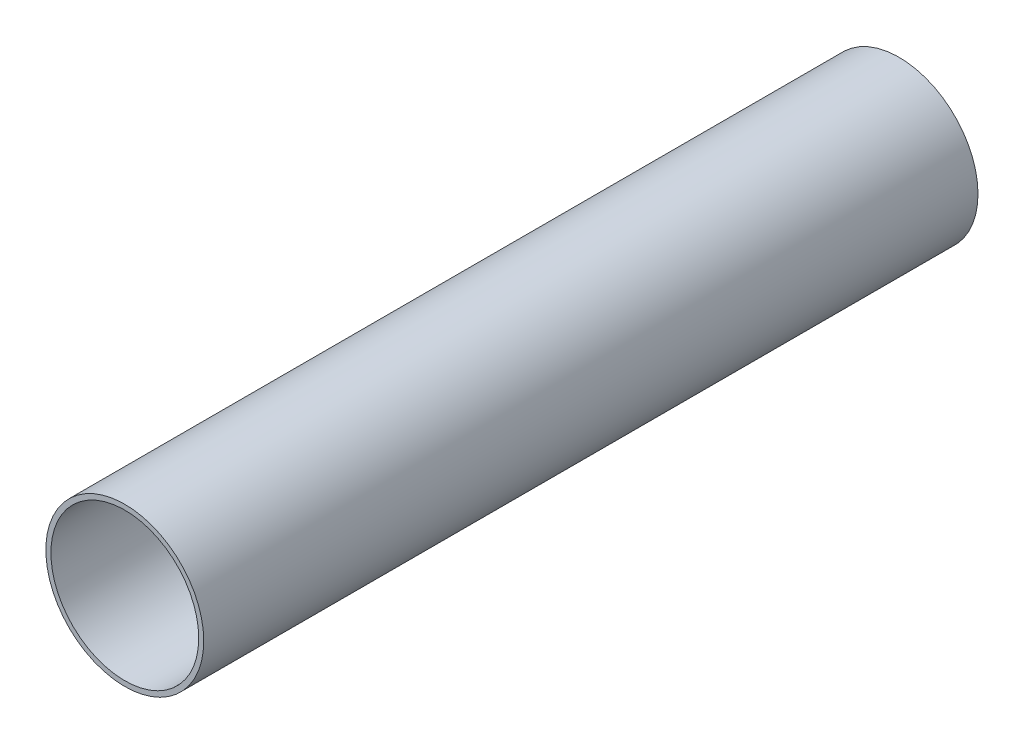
ISO-10303-21;
HEADER;
FILE_DESCRIPTION(('STEP AP214'),'2;1');
FILE_NAME('part.step','',(''),(''),'','','');
FILE_SCHEMA(('AUTOMOTIVE_DESIGN { 1 0 10303 214 1 1 1 1 }'));
ENDSEC;
DATA;
#1=APPLICATION_CONTEXT('core data for automotive mechanical design processes');
#2=APPLICATION_PROTOCOL_DEFINITION('international standard','automotive_design',2000,#1);
#3=PRODUCT_CONTEXT('',#1,'mechanical');
#4=PRODUCT('Part','Part','',(#3));
#5=PRODUCT_RELATED_PRODUCT_CATEGORY('part','',(#4));
#6=PRODUCT_DEFINITION_FORMATION('','',#4);
#7=PRODUCT_DEFINITION_CONTEXT('part definition',#1,'design');
#8=PRODUCT_DEFINITION('design','',#6,#7);
#9=PRODUCT_DEFINITION_SHAPE('','',#8);
#10=(LENGTH_UNIT() NAMED_UNIT(*) SI_UNIT(.MILLI.,.METRE.));
#11=(NAMED_UNIT(*) PLANE_ANGLE_UNIT() SI_UNIT($,.RADIAN.));
#12=(NAMED_UNIT(*) SI_UNIT($,.STERADIAN.) SOLID_ANGLE_UNIT());
#13=UNCERTAINTY_MEASURE_WITH_UNIT(LENGTH_MEASURE(1.E-05),#10,'distance_accuracy_value','');
#14=(GEOMETRIC_REPRESENTATION_CONTEXT(3) GLOBAL_UNCERTAINTY_ASSIGNED_CONTEXT((#13)) GLOBAL_UNIT_ASSIGNED_CONTEXT((#10,
#11,#12)) REPRESENTATION_CONTEXT('',''));
#15=CARTESIAN_POINT('',(0.,0.,0.));
#16=DIRECTION('',(0.,0.,1.));
#17=DIRECTION('',(1.,0.,0.));
#18=AXIS2_PLACEMENT_3D('',#15,#16,#17);
#19=CARTESIAN_POINT('',(-395.,0.,593.825223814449));
#20=DIRECTION('',(0.,0.,-1.));
#21=DIRECTION('',(-1.,0.,0.));
#22=AXIS2_PLACEMENT_3D('',#19,#20,#21);
#23=CYLINDRICAL_SURFACE('',#22,47.);
#24=CARTESIAN_POINT('',(-395.,0.,0.));
#25=DIRECTION('',(0.,0.,1.));
#26=DIRECTION('',(1.,0.,0.));
#27=AXIS2_PLACEMENT_3D('',#24,#25,#26);
#28=CIRCLE('',#27,47.);
#29=CARTESIAN_POINT('',(-348.,0.,0.));
#30=VERTEX_POINT('',#29);
#31=EDGE_CURVE('E37',#30,#30,#28,.T.);
#32=ORIENTED_EDGE('',*,*,#31,.T.);
#33=EDGE_LOOP('',(#32));
#34=FACE_BOUND('',#33,.T.);
#35=CARTESIAN_POINT('',(-395.,0.,460.889148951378));
#36=DIRECTION('',(0.,0.,1.));
#37=DIRECTION('',(1.,0.,0.));
#38=AXIS2_PLACEMENT_3D('',#35,#36,#37);
#39=CIRCLE('',#38,47.);
#40=CARTESIAN_POINT('',(-348.,0.,460.889148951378));
#41=VERTEX_POINT('',#40);
#42=EDGE_CURVE('E10',#41,#41,#39,.T.);
#43=ORIENTED_EDGE('',*,*,#42,.F.);
#44=EDGE_LOOP('',(#43));
#45=FACE_BOUND('',#44,.T.);
#46=ADVANCED_FACE('F30',(#34,#45),#23,.T.);
#47=CARTESIAN_POINT('',(-395.,0.,0.));
#48=DIRECTION('',(0.,0.,1.));
#49=DIRECTION('',(1.,0.,0.));
#50=AXIS2_PLACEMENT_3D('',#47,#48,#49);
#51=PLANE('',#50);
#52=ORIENTED_EDGE('',*,*,#31,.F.);
#53=EDGE_LOOP('',(#52));
#54=FACE_BOUND('',#53,.T.);
#55=ADVANCED_FACE('F60',(#54),#51,.F.);
#56=CARTESIAN_POINT('',(-380.,-4.37150315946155E-13,460.889148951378));
#57=DIRECTION('',(0.,0.,1.));
#58=DIRECTION('',(1.,0.,0.));
#59=AXIS2_PLACEMENT_3D('',#56,#57,#58);
#60=PLANE('',#59);
#61=CARTESIAN_POINT('',(-395.,0.,460.889148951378));
#62=DIRECTION('',(0.,0.,1.));
#63=DIRECTION('',(1.,0.,0.));
#64=AXIS2_PLACEMENT_3D('',#61,#62,#63);
#65=CIRCLE('',#64,44.);
#66=CARTESIAN_POINT('',(-351.,0.,460.889148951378));
#67=VERTEX_POINT('',#66);
#68=EDGE_CURVE('E41',#67,#67,#65,.T.);
#69=ORIENTED_EDGE('',*,*,#68,.F.);
#70=EDGE_LOOP('',(#69));
#71=FACE_BOUND('',#70,.T.);
#72=ORIENTED_EDGE('',*,*,#42,.T.);
#73=EDGE_LOOP('',(#72));
#74=FACE_BOUND('',#73,.T.);
#75=ADVANCED_FACE('F32',(#71,#74),#60,.T.);
#76=CARTESIAN_POINT('',(-395.,0.,593.825223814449));
#77=DIRECTION('',(0.,0.,-1.));
#78=DIRECTION('',(-1.,0.,0.));
#79=AXIS2_PLACEMENT_3D('',#76,#77,#78);
#80=CYLINDRICAL_SURFACE('',#79,44.);
#81=CARTESIAN_POINT('',(-395.,0.,3.));
#82=DIRECTION('',(0.,0.,1.));
#83=DIRECTION('',(1.,0.,0.));
#84=AXIS2_PLACEMENT_3D('',#81,#82,#83);
#85=CIRCLE('',#84,44.);
#86=CARTESIAN_POINT('',(-351.,0.,3.));
#87=VERTEX_POINT('',#86);
#88=EDGE_CURVE('E45',#87,#87,#85,.T.);
#89=ORIENTED_EDGE('',*,*,#88,.F.);
#90=EDGE_LOOP('',(#89));
#91=FACE_BOUND('',#90,.T.);
#92=ORIENTED_EDGE('',*,*,#68,.T.);
#93=EDGE_LOOP('',(#92));
#94=FACE_BOUND('',#93,.T.);
#95=ADVANCED_FACE('F53',(#91,#94),#80,.F.);
#96=CARTESIAN_POINT('',(-395.,0.,3.));
#97=DIRECTION('',(0.,0.,1.));
#98=DIRECTION('',(1.,0.,0.));
#99=AXIS2_PLACEMENT_3D('',#96,#97,#98);
#100=PLANE('',#99);
#101=ORIENTED_EDGE('',*,*,#88,.T.);
#102=EDGE_LOOP('',(#101));
#103=FACE_BOUND('',#102,.T.);
#104=ADVANCED_FACE('F51',(#103),#100,.T.);
#105=CLOSED_SHELL('',(#46,#55,#75,#95,#104));
#106=MANIFOLD_SOLID_BREP('B2',#105);
#107=ADVANCED_BREP_SHAPE_REPRESENTATION('',(#18,#106),#14);
#108=SHAPE_DEFINITION_REPRESENTATION(#9,#107);
ENDSEC;
END-ISO-10303-21;
